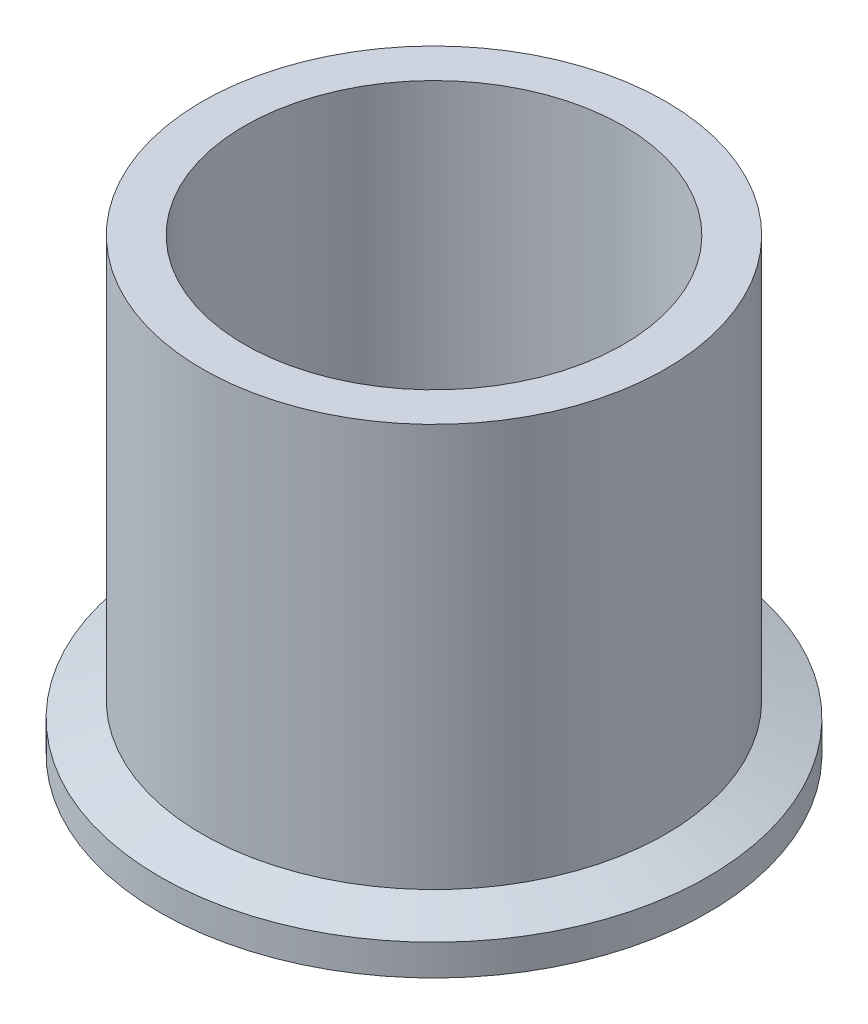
from build123d import *


with BuildPart() as part:
    # Sketch1 → Revolve2 (revolve)
    with BuildSketch(Plane.XY, mode=Mode.PRIVATE) as revolve2_sk:
        with BuildLine():
            Line((-17.399, 0), (-17.399, 41.275))
            Line((-17.399, 41.275), (-21.2852, 41.275))
            Line((-21.2852, 41.275), (-21.2852, 4.268505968))
            Line((-21.2852, 4.268505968), (-25.1968, 2.8448))
            Line((-25.1968, 2.8448), (-25.1968, 0))
            Line((-25.1968, 0), (-23.636608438, 0))
            ThreePointArc((-23.636608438, 0), (-23.204411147, 0.129217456), (-22.914066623, 0.474458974))
            ThreePointArc((-22.914066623, 0.474458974), (-21.8186, 1.1938), (-20.723133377, 0.474458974))
            ThreePointArc((-20.723133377, 0.474458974), (-20.432788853, 0.129217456), (-20.000591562, 0))
            Line((-20.000591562, 0), (-17.399, 0))
        make_face()
    revolve(revolve2_sk.sketch.rotate(Axis((0, 0, 0), (0, 1, 0)), 270), axis=Axis((0, 0, 0), (0, 1, 0)))


solid = part.part
